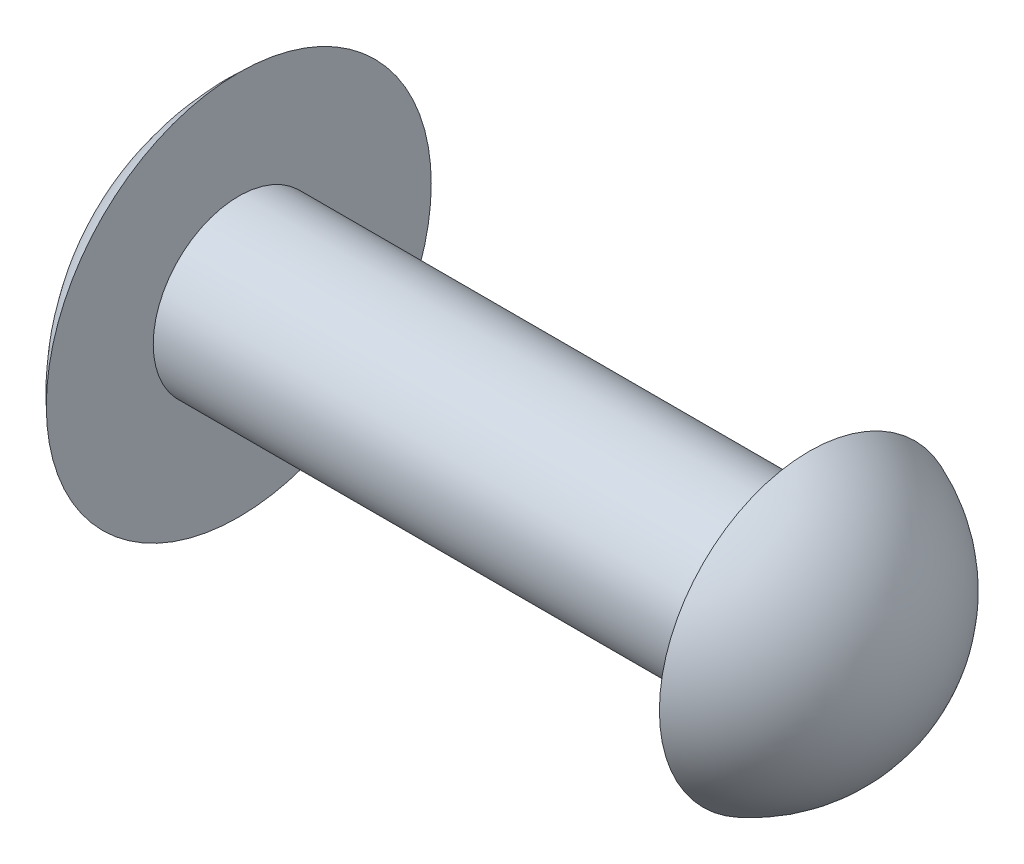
from build123d import *


with BuildPart() as part:
    # Sketch1 → Base-Revolve (revolve)
    with BuildSketch(Plane.XY, mode=Mode.PRIVATE) as base_revolve_sk:
        with BuildLine():
            Line((-23, 0), (0, 0))
            Line((0, 0), (0, 3))
            Line((0, 3), (-20, 3))
            Line((-20, 3), (-20, 6.75))
            ThreePointArc((-20, 6.75), (-22.21622377, 3.693321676), (-23, 0))
        make_face()
    revolve(base_revolve_sk.sketch.rotate(Axis((-39, 0, 0), (1, 0, 0)), 90), axis=Axis((-39, 0, 0), (1, 0, 0)))

    # Sketch2 → HeadTypeA (revolve)
    with BuildSketch(Plane.XY):
        with BuildLine():
            Line((0, 0), (3.6, 0))
            ThreePointArc((3.6, 0), (2.613552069, 3.182864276), (0, 5.25))
            Line((0, 5.25), (0, 0))
        make_face()
    revolve(axis=Axis((-49, 0, 0), (1, 0, 0)))


solid = part.part
